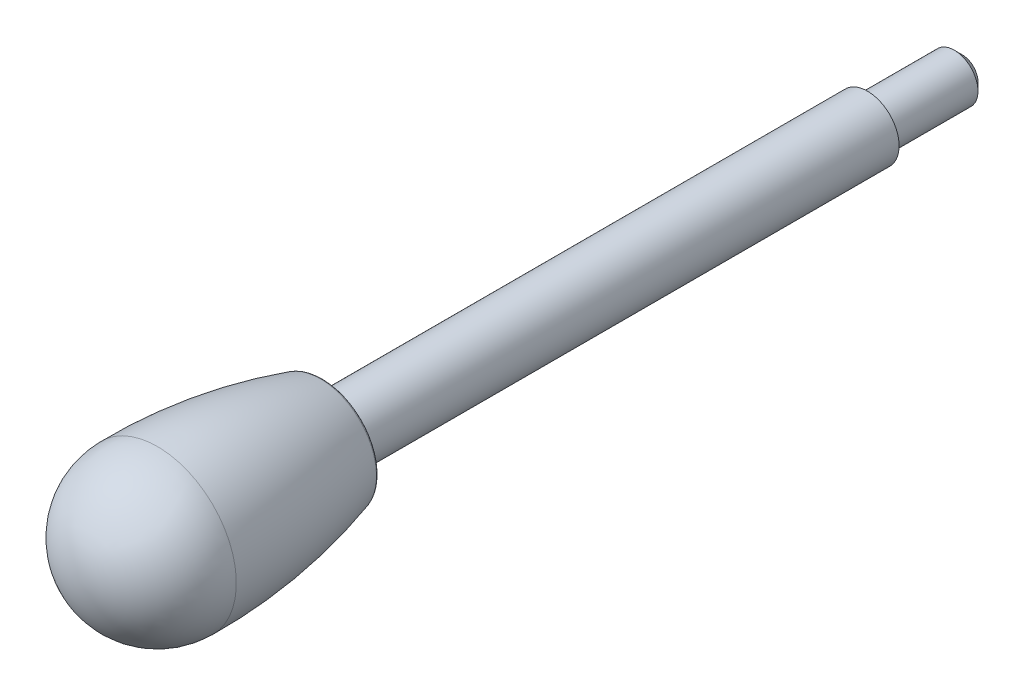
ISO-10303-21;
HEADER;
FILE_DESCRIPTION(('STEP AP214'),'2;1');
FILE_NAME('part.step','',(''),(''),'','','');
FILE_SCHEMA(('AUTOMOTIVE_DESIGN { 1 0 10303 214 1 1 1 1 }'));
ENDSEC;
DATA;
#1=APPLICATION_CONTEXT('core data for automotive mechanical design processes');
#2=APPLICATION_PROTOCOL_DEFINITION('international standard','automotive_design',2000,#1);
#3=PRODUCT_CONTEXT('',#1,'mechanical');
#4=PRODUCT('Part','Part','',(#3));
#5=PRODUCT_RELATED_PRODUCT_CATEGORY('part','',(#4));
#6=PRODUCT_DEFINITION_FORMATION('','',#4);
#7=PRODUCT_DEFINITION_CONTEXT('part definition',#1,'design');
#8=PRODUCT_DEFINITION('design','',#6,#7);
#9=PRODUCT_DEFINITION_SHAPE('','',#8);
#10=(LENGTH_UNIT() NAMED_UNIT(*) SI_UNIT(.MILLI.,.METRE.));
#11=(NAMED_UNIT(*) PLANE_ANGLE_UNIT() SI_UNIT($,.RADIAN.));
#12=(NAMED_UNIT(*) SI_UNIT($,.STERADIAN.) SOLID_ANGLE_UNIT());
#13=UNCERTAINTY_MEASURE_WITH_UNIT(LENGTH_MEASURE(1.E-05),#10,'distance_accuracy_value','');
#14=(GEOMETRIC_REPRESENTATION_CONTEXT(3) GLOBAL_UNCERTAINTY_ASSIGNED_CONTEXT((#13)) GLOBAL_UNIT_ASSIGNED_CONTEXT((#10,
#11,#12)) REPRESENTATION_CONTEXT('',''));
#15=CARTESIAN_POINT('',(0.,0.,0.));
#16=DIRECTION('',(0.,0.,1.));
#17=DIRECTION('',(1.,0.,0.));
#18=AXIS2_PLACEMENT_3D('',#15,#16,#17);
#19=CARTESIAN_POINT('',(0.,0.,-26.9796802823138));
#20=DIRECTION('',(0.,0.,-1.));
#21=DIRECTION('',(-1.,0.,0.));
#22=AXIS2_PLACEMENT_3D('',#19,#20,#21);
#23=CYLINDRICAL_SURFACE('',#22,3.);
#24=CARTESIAN_POINT('',(0.,0.,-11.));
#25=DIRECTION('',(0.,0.,-1.));
#26=DIRECTION('',(-1.,0.,0.));
#27=AXIS2_PLACEMENT_3D('',#24,#25,#26);
#28=CIRCLE('',#27,3.);
#29=CARTESIAN_POINT('',(-3.,0.,-11.));
#30=VERTEX_POINT('',#29);
#31=EDGE_CURVE('E40',#30,#30,#28,.T.);
#32=ORIENTED_EDGE('',*,*,#31,.F.);
#33=EDGE_LOOP('',(#32));
#34=FACE_BOUND('',#33,.T.);
#35=CARTESIAN_POINT('',(0.,0.,0.));
#36=DIRECTION('',(0.,0.,-1.));
#37=DIRECTION('',(-1.,0.,0.));
#38=AXIS2_PLACEMENT_3D('',#35,#36,#37);
#39=CIRCLE('',#38,3.);
#40=CARTESIAN_POINT('',(-3.,0.,0.));
#41=VERTEX_POINT('',#40);
#42=EDGE_CURVE('E8',#41,#41,#39,.T.);
#43=ORIENTED_EDGE('',*,*,#42,.T.);
#44=EDGE_LOOP('',(#43));
#45=FACE_BOUND('',#44,.T.);
#46=ADVANCED_FACE('F12',(#34,#45),#23,.T.);
#47=CARTESIAN_POINT('',(0.,-4.,0.));
#48=DIRECTION('',(0.,0.,1.));
#49=DIRECTION('',(1.,0.,0.));
#50=AXIS2_PLACEMENT_3D('',#47,#48,#49);
#51=PLANE('',#50);
#52=ORIENTED_EDGE('',*,*,#42,.F.);
#53=EDGE_LOOP('',(#52));
#54=FACE_BOUND('',#53,.T.);
#55=CARTESIAN_POINT('',(0.,0.,0.));
#56=DIRECTION('',(0.,0.,-1.));
#57=DIRECTION('',(-1.,0.,0.));
#58=AXIS2_PLACEMENT_3D('',#55,#56,#57);
#59=CIRCLE('',#58,4.);
#60=CARTESIAN_POINT('',(-4.,0.,0.));
#61=VERTEX_POINT('',#60);
#62=EDGE_CURVE('E18',#61,#61,#59,.T.);
#63=ORIENTED_EDGE('',*,*,#62,.T.);
#64=EDGE_LOOP('',(#63));
#65=FACE_BOUND('',#64,.T.);
#66=ADVANCED_FACE('F47',(#54,#65),#51,.F.);
#67=CARTESIAN_POINT('',(0.,0.,-26.9796802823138));
#68=DIRECTION('',(0.,0.,-1.));
#69=DIRECTION('',(-1.,0.,0.));
#70=AXIS2_PLACEMENT_3D('',#67,#68,#69);
#71=CYLINDRICAL_SURFACE('',#70,4.);
#72=ORIENTED_EDGE('',*,*,#62,.F.);
#73=EDGE_LOOP('',(#72));
#74=FACE_BOUND('',#73,.T.);
#75=CARTESIAN_POINT('',(0.,0.,69.));
#76=DIRECTION('',(0.,0.,-1.));
#77=DIRECTION('',(-1.,0.,0.));
#78=AXIS2_PLACEMENT_3D('',#75,#76,#77);
#79=CIRCLE('',#78,4.);
#80=CARTESIAN_POINT('',(-4.,0.,69.));
#81=VERTEX_POINT('',#80);
#82=EDGE_CURVE('E22',#81,#81,#79,.T.);
#83=ORIENTED_EDGE('',*,*,#82,.T.);
#84=EDGE_LOOP('',(#83));
#85=FACE_BOUND('',#84,.T.);
#86=ADVANCED_FACE('F53',(#74,#85),#71,.T.);
#87=CARTESIAN_POINT('',(0.,-6.62794066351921,69.));
#88=DIRECTION('',(0.,0.,1.));
#89=DIRECTION('',(1.,0.,0.));
#90=AXIS2_PLACEMENT_3D('',#87,#88,#89);
#91=PLANE('',#90);
#92=ORIENTED_EDGE('',*,*,#82,.F.);
#93=EDGE_LOOP('',(#92));
#94=FACE_BOUND('',#93,.T.);
#95=CARTESIAN_POINT('',(0.,0.,69.));
#96=DIRECTION('',(0.,0.,-1.));
#97=DIRECTION('',(-1.,0.,0.));
#98=AXIS2_PLACEMENT_3D('',#95,#96,#97);
#99=CIRCLE('',#98,6.62794066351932);
#100=CARTESIAN_POINT('',(-6.62794066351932,0.,69.));
#101=VERTEX_POINT('',#100);
#102=EDGE_CURVE('E26',#101,#101,#99,.T.);
#103=ORIENTED_EDGE('',*,*,#102,.T.);
#104=EDGE_LOOP('',(#103));
#105=FACE_BOUND('',#104,.T.);
#106=ADVANCED_FACE('F59',(#94,#105),#91,.F.);
#107=CARTESIAN_POINT('',(0.,0.,69.5));
#108=DIRECTION('',(0.,0.,-1.));
#109=DIRECTION('',(-1.,0.,0.));
#110=AXIS2_PLACEMENT_3D('',#107,#108,#109);
#111=TOROIDAL_SURFACE('',#110,6.62794066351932,0.500000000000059);
#112=ORIENTED_EDGE('',*,*,#102,.F.);
#113=EDGE_LOOP('',(#112));
#114=FACE_BOUND('',#113,.T.);
#115=CARTESIAN_POINT('',(0.,0.,69.357660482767));
#116=DIRECTION('',(0.,0.,-1.));
#117=DIRECTION('',(-1.,0.,0.));
#118=AXIS2_PLACEMENT_3D('',#115,#116,#117);
#119=CIRCLE('',#118,7.10725210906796);
#120=CARTESIAN_POINT('',(-7.10725210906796,0.,69.357660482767));
#121=VERTEX_POINT('',#120);
#122=EDGE_CURVE('E31',#121,#121,#119,.T.);
#123=ORIENTED_EDGE('',*,*,#122,.T.);
#124=EDGE_LOOP('',(#123));
#125=FACE_BOUND('',#124,.T.);
#126=ADVANCED_FACE('F65',(#114,#125),#111,.T.);
#127=CARTESIAN_POINT('',(0.,0.,89.2851928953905));
#128=DIRECTION('',(0.,0.,-1.));
#129=DIRECTION('',(-1.,0.,0.));
#130=AXIS2_PLACEMENT_3D('',#127,#128,#129);
#131=DEGENERATE_TOROIDAL_SURFACE('',#130,59.9963502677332,70.,.F.);
#132=ORIENTED_EDGE('',*,*,#122,.F.);
#133=EDGE_LOOP('',(#132));
#134=FACE_BOUND('',#133,.T.);
#135=CARTESIAN_POINT('',(0.,0.,90.));
#136=DIRECTION('',(0.,0.,-1.));
#137=DIRECTION('',(-1.,0.,0.));
#138=AXIS2_PLACEMENT_3D('',#135,#136,#137);
#139=CIRCLE('',#138,10.);
#140=CARTESIAN_POINT('',(-10.,0.,90.));
#141=VERTEX_POINT('',#140);
#142=EDGE_CURVE('E34',#141,#141,#139,.T.);
#143=ORIENTED_EDGE('',*,*,#142,.T.);
#144=EDGE_LOOP('',(#143));
#145=FACE_BOUND('',#144,.T.);
#146=ADVANCED_FACE('F69',(#134,#145),#131,.F.);
#147=CARTESIAN_POINT('',(0.,0.,90.));
#148=DIRECTION('',(-1.,0.,0.));
#149=DIRECTION('',(0.,0.,1.));
#150=AXIS2_PLACEMENT_3D('',#147,#148,#149);
#151=SPHERICAL_SURFACE('',#150,10.);
#152=CARTESIAN_POINT('',(0.,0.,90.));
#153=DIRECTION('',(0.,0.,-1.));
#154=DIRECTION('',(-1.,0.,0.));
#155=AXIS2_PLACEMENT_3D('',#152,#153,#154);
#156=SPHERICAL_SURFACE('',#155,10.);
#157=ORIENTED_EDGE('',*,*,#142,.F.);
#158=EDGE_LOOP('',(#157));
#159=FACE_BOUND('',#158,.T.);
#160=ADVANCED_FACE('F73',(#159),#156,.T.);
#161=CARTESIAN_POINT('',(0.,0.,-12.));
#162=DIRECTION('',(0.,0.,-1.));
#163=DIRECTION('',(-1.,0.,0.));
#164=AXIS2_PLACEMENT_3D('',#161,#162,#163);
#165=PLANE('',#164);
#166=CARTESIAN_POINT('',(0.,0.,-12.));
#167=DIRECTION('',(0.,0.,-1.));
#168=DIRECTION('',(-1.,0.,0.));
#169=AXIS2_PLACEMENT_3D('',#166,#167,#168);
#170=CIRCLE('',#169,2.);
#171=CARTESIAN_POINT('',(-2.,0.,-12.));
#172=VERTEX_POINT('',#171);
#173=EDGE_CURVE('E37',#172,#172,#170,.T.);
#174=ORIENTED_EDGE('',*,*,#173,.T.);
#175=EDGE_LOOP('',(#174));
#176=FACE_BOUND('',#175,.T.);
#177=ADVANCED_FACE('F77',(#176),#165,.T.);
#178=CARTESIAN_POINT('',(0.,0.,-11.));
#179=DIRECTION('',(0.,0.,1.));
#180=DIRECTION('',(1.,0.,0.));
#181=AXIS2_PLACEMENT_3D('',#178,#179,#180);
#182=CONICAL_SURFACE('',#181,3.,0.785398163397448);
#183=ORIENTED_EDGE('',*,*,#173,.F.);
#184=EDGE_LOOP('',(#183));
#185=FACE_BOUND('',#184,.T.);
#186=ORIENTED_EDGE('',*,*,#31,.T.);
#187=EDGE_LOOP('',(#186));
#188=FACE_BOUND('',#187,.T.);
#189=ADVANCED_FACE('F44',(#185,#188),#182,.T.);
#190=CLOSED_SHELL('',(#46,#66,#86,#106,#126,#146,#160,#177,#189));
#191=MANIFOLD_SOLID_BREP('B1',#190);
#192=ADVANCED_BREP_SHAPE_REPRESENTATION('',(#18,#191),#14);
#193=SHAPE_DEFINITION_REPRESENTATION(#9,#192);
ENDSEC;
END-ISO-10303-21;
